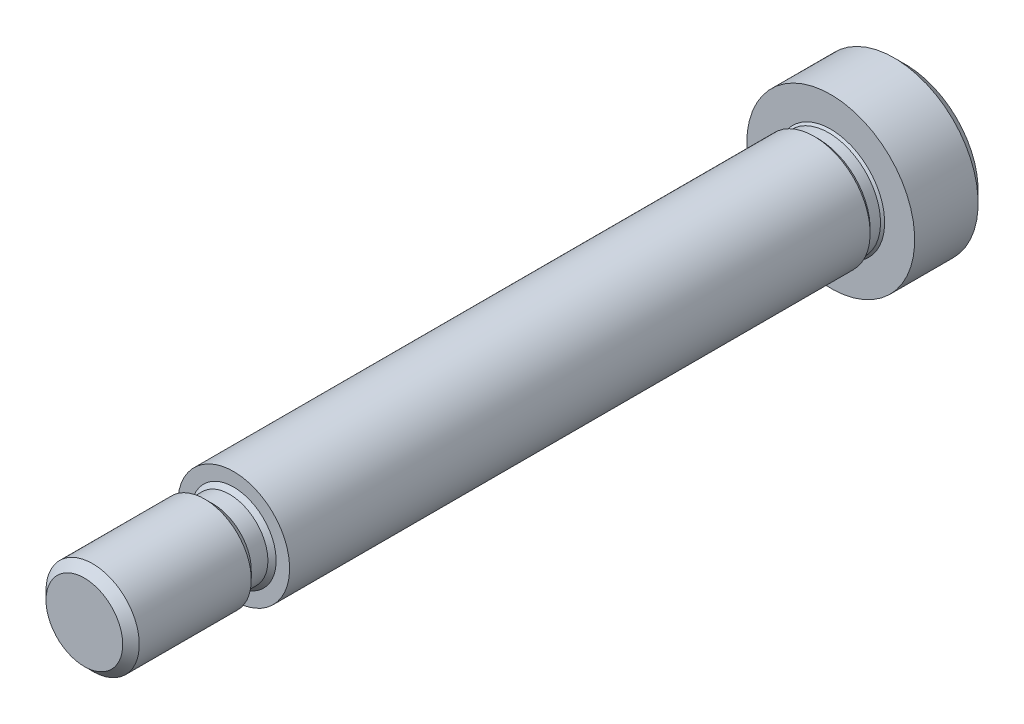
from build123d import *

# Parameters (mm, degrees)
CUT_EXTRUDE1_DEPTH = 4.233333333


with BuildPart() as part:
    # Logo3_bib1 → Revolve1 (revolve)
    with BuildSketch(Plane(origin=(0, 0, 0), x_dir=(-1, 0, 0), z_dir=(0, -1, 0))):
        Polygon((4.7625, 0), (3.616325, 0), (3.2639, -0.352425), (3.2639, -1.762125), (3.96875, -2.466975), (3.96875, -11.99515), (3.2639, -12.7), (0, -12.7), (0, 57.15), (6.19125, 57.15), (7.14375, 56.1975), (7.14375, 50.8), (4.5862875, 50.8), (4.410075, 50.6237875), (4.410075, 49.742725), (4.7625, 49.3903), align=None)
    revolve(axis=Axis((0, 0, -62.352722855), (0, 0, 1)))

    # Logo3_bib2 → Cut-Extrude1 (cut)
    with BuildSketch(Plane(origin=(0, 0, -57.15), x_dir=(1, 0, 0), z_dir=(0, 0, -1))):
        Polygon((2.749630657, 0), (1.374815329, 2.38125), (-1.374815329, 2.38125), (-2.749630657, 0), (-1.374815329, -2.38125), (1.374815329, -2.38125), align=None)
    extrude(amount=-CUT_EXTRUDE1_DEPTH, mode=Mode.SUBTRACT)


solid = part.part
